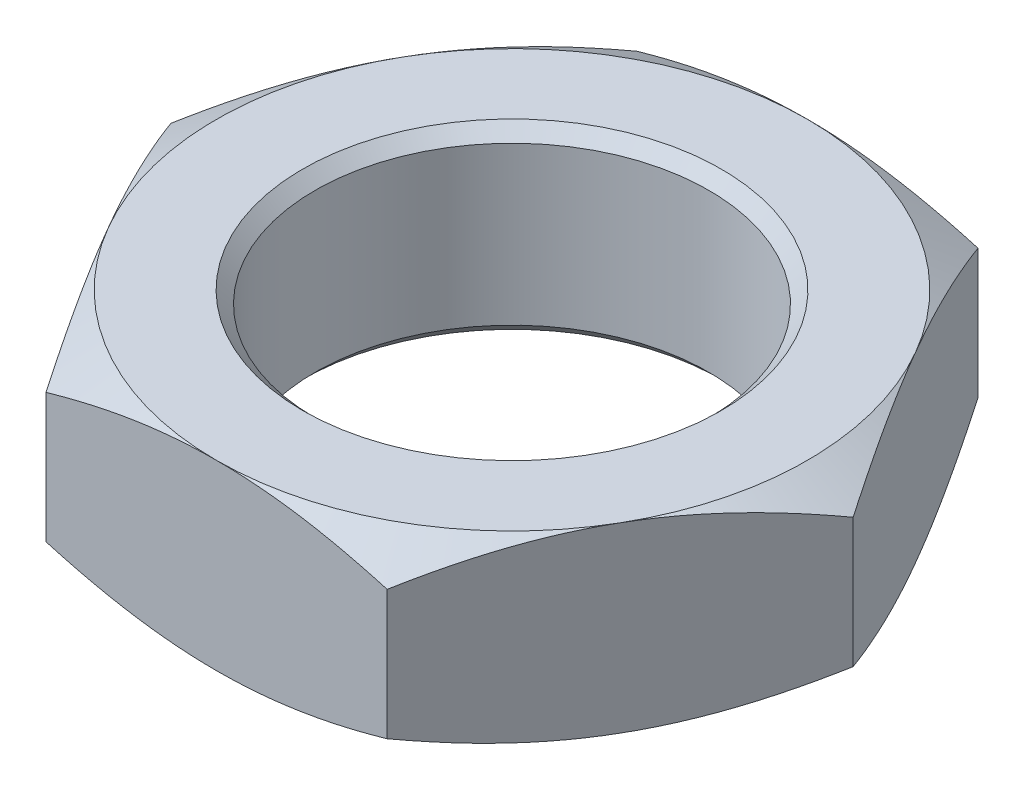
ISO-10303-21;
HEADER;
FILE_DESCRIPTION(('STEP AP214'),'2;1');
FILE_NAME('part.step','',(''),(''),'','','');
FILE_SCHEMA(('AUTOMOTIVE_DESIGN { 1 0 10303 214 1 1 1 1 }'));
ENDSEC;
DATA;
#1=APPLICATION_CONTEXT('core data for automotive mechanical design processes');
#2=APPLICATION_PROTOCOL_DEFINITION('international standard','automotive_design',2000,#1);
#3=PRODUCT_CONTEXT('',#1,'mechanical');
#4=PRODUCT('Part','Part','',(#3));
#5=PRODUCT_RELATED_PRODUCT_CATEGORY('part','',(#4));
#6=PRODUCT_DEFINITION_FORMATION('','',#4);
#7=PRODUCT_DEFINITION_CONTEXT('part definition',#1,'design');
#8=PRODUCT_DEFINITION('design','',#6,#7);
#9=PRODUCT_DEFINITION_SHAPE('','',#8);
#10=(LENGTH_UNIT() NAMED_UNIT(*) SI_UNIT(.MILLI.,.METRE.));
#11=(NAMED_UNIT(*) PLANE_ANGLE_UNIT() SI_UNIT($,.RADIAN.));
#12=(NAMED_UNIT(*) SI_UNIT($,.STERADIAN.) SOLID_ANGLE_UNIT());
#13=UNCERTAINTY_MEASURE_WITH_UNIT(LENGTH_MEASURE(1.E-05),#10,'distance_accuracy_value','');
#14=(GEOMETRIC_REPRESENTATION_CONTEXT(3) GLOBAL_UNCERTAINTY_ASSIGNED_CONTEXT((#13)) GLOBAL_UNIT_ASSIGNED_CONTEXT((#10,
#11,#12)) REPRESENTATION_CONTEXT('',''));
#15=CARTESIAN_POINT('',(0.,0.,0.));
#16=DIRECTION('',(0.,0.,1.));
#17=DIRECTION('',(1.,0.,0.));
#18=AXIS2_PLACEMENT_3D('',#15,#16,#17);
#19=CARTESIAN_POINT('',(0.,3.7,0.));
#20=DIRECTION('',(0.,1.,0.));
#21=DIRECTION('',(0.,0.,1.));
#22=AXIS2_PLACEMENT_3D('',#19,#20,#21);
#23=PLANE('',#22);
#24=CARTESIAN_POINT('',(0.,3.7,0.));
#25=DIRECTION('',(0.,1.,0.));
#26=DIRECTION('',(0.,0.,1.));
#27=AXIS2_PLACEMENT_3D('',#24,#25,#26);
#28=CIRCLE('',#27,8.5);
#29=CARTESIAN_POINT('',(0.,3.7,8.5));
#30=VERTEX_POINT('',#29);
#31=EDGE_CURVE('E11',#30,#30,#28,.F.);
#32=ORIENTED_EDGE('',*,*,#31,.T.);
#33=EDGE_LOOP('',(#32));
#34=FACE_BOUND('',#33,.T.);
#35=CARTESIAN_POINT('',(0.,3.7,0.));
#36=DIRECTION('',(0.,1.,0.));
#37=DIRECTION('',(0.,0.,1.));
#38=AXIS2_PLACEMENT_3D('',#35,#36,#37);
#39=CIRCLE('',#38,12.);
#40=CARTESIAN_POINT('',(-10.3923048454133,3.7,6.));
#41=VERTEX_POINT('',#40);
#42=CARTESIAN_POINT('',(0.,3.7,12.));
#43=VERTEX_POINT('',#42);
#44=EDGE_CURVE('E142',#41,#43,#39,.T.);
#45=ORIENTED_EDGE('',*,*,#44,.T.);
#46=CARTESIAN_POINT('',(10.3923048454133,3.7,6.));
#47=VERTEX_POINT('',#46);
#48=EDGE_CURVE('E175',#43,#47,#39,.T.);
#49=ORIENTED_EDGE('',*,*,#48,.T.);
#50=CARTESIAN_POINT('',(10.3923048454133,3.7,-6.));
#51=VERTEX_POINT('',#50);
#52=EDGE_CURVE('E179',#47,#51,#39,.T.);
#53=ORIENTED_EDGE('',*,*,#52,.T.);
#54=CARTESIAN_POINT('',(0.,3.7,-12.));
#55=VERTEX_POINT('',#54);
#56=EDGE_CURVE('E322',#51,#55,#39,.T.);
#57=ORIENTED_EDGE('',*,*,#56,.T.);
#58=CARTESIAN_POINT('',(-10.3923048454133,3.7,-6.));
#59=VERTEX_POINT('',#58);
#60=EDGE_CURVE('E55',#55,#59,#39,.T.);
#61=ORIENTED_EDGE('',*,*,#60,.T.);
#62=EDGE_CURVE('E63',#59,#41,#39,.T.);
#63=ORIENTED_EDGE('',*,*,#62,.T.);
#64=EDGE_LOOP('',(#45,#49,#53,#57,#61,#63));
#65=FACE_BOUND('',#64,.T.);
#66=ADVANCED_FACE('F39',(#34,#65),#23,.T.);
#67=CARTESIAN_POINT('',(0.,-3.7,0.));
#68=DIRECTION('',(0.,1.,0.));
#69=DIRECTION('',(0.,0.,1.));
#70=AXIS2_PLACEMENT_3D('',#67,#68,#69);
#71=PLANE('',#70);
#72=CARTESIAN_POINT('',(0.,-3.7,0.));
#73=DIRECTION('',(0.,1.,0.));
#74=DIRECTION('',(0.,0.,1.));
#75=AXIS2_PLACEMENT_3D('',#72,#73,#74);
#76=CIRCLE('',#75,8.5);
#77=CARTESIAN_POINT('',(0.,-3.7,8.5));
#78=VERTEX_POINT('',#77);
#79=EDGE_CURVE('E329',#78,#78,#76,.T.);
#80=ORIENTED_EDGE('',*,*,#79,.T.);
#81=EDGE_LOOP('',(#80));
#82=FACE_BOUND('',#81,.T.);
#83=CARTESIAN_POINT('',(0.,-3.7,0.));
#84=DIRECTION('',(0.,1.,0.));
#85=DIRECTION('',(0.,0.,1.));
#86=AXIS2_PLACEMENT_3D('',#83,#84,#85);
#87=CIRCLE('',#86,12.);
#88=CARTESIAN_POINT('',(0.,-3.7,12.));
#89=VERTEX_POINT('',#88);
#90=CARTESIAN_POINT('',(10.3923048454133,-3.7,6.));
#91=VERTEX_POINT('',#90);
#92=EDGE_CURVE('E130',#89,#91,#87,.T.);
#93=ORIENTED_EDGE('',*,*,#92,.F.);
#94=CARTESIAN_POINT('',(-10.3923048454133,-3.7,6.));
#95=VERTEX_POINT('',#94);
#96=EDGE_CURVE('E145',#95,#89,#87,.T.);
#97=ORIENTED_EDGE('',*,*,#96,.F.);
#98=CARTESIAN_POINT('',(-10.3923048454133,-3.7,-6.));
#99=VERTEX_POINT('',#98);
#100=EDGE_CURVE('E387',#99,#95,#87,.T.);
#101=ORIENTED_EDGE('',*,*,#100,.F.);
#102=CARTESIAN_POINT('',(0.,-3.7,-12.));
#103=VERTEX_POINT('',#102);
#104=EDGE_CURVE('E173',#103,#99,#87,.T.);
#105=ORIENTED_EDGE('',*,*,#104,.F.);
#106=CARTESIAN_POINT('',(10.3923048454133,-3.7,-6.));
#107=VERTEX_POINT('',#106);
#108=EDGE_CURVE('E169',#107,#103,#87,.T.);
#109=ORIENTED_EDGE('',*,*,#108,.F.);
#110=EDGE_CURVE('E143',#91,#107,#87,.T.);
#111=ORIENTED_EDGE('',*,*,#110,.F.);
#112=EDGE_LOOP('',(#93,#97,#101,#105,#109,#111));
#113=FACE_BOUND('',#112,.T.);
#114=ADVANCED_FACE('F167',(#82,#113),#71,.F.);
#115=CARTESIAN_POINT('',(0.,3.7,0.));
#116=DIRECTION('',(0.,-1.,0.));
#117=DIRECTION('',(0.,0.,-1.));
#118=AXIS2_PLACEMENT_3D('',#115,#116,#117);
#119=CYLINDRICAL_SURFACE('',#118,8.);
#120=CARTESIAN_POINT('',(0.,-3.2,0.));
#121=DIRECTION('',(0.,1.,0.));
#122=DIRECTION('',(0.,0.,1.));
#123=AXIS2_PLACEMENT_3D('',#120,#121,#122);
#124=CIRCLE('',#123,8.);
#125=CARTESIAN_POINT('',(0.,-3.2,8.));
#126=VERTEX_POINT('',#125);
#127=EDGE_CURVE('E48',#126,#126,#124,.F.);
#128=ORIENTED_EDGE('',*,*,#127,.T.);
#129=EDGE_LOOP('',(#128));
#130=FACE_BOUND('',#129,.T.);
#131=CARTESIAN_POINT('',(0.,3.2,0.));
#132=DIRECTION('',(0.,1.,0.));
#133=DIRECTION('',(0.,0.,1.));
#134=AXIS2_PLACEMENT_3D('',#131,#132,#133);
#135=CIRCLE('',#134,8.);
#136=CARTESIAN_POINT('',(0.,3.2,8.));
#137=VERTEX_POINT('',#136);
#138=EDGE_CURVE('E326',#137,#137,#135,.T.);
#139=ORIENTED_EDGE('',*,*,#138,.T.);
#140=EDGE_LOOP('',(#139));
#141=FACE_BOUND('',#140,.T.);
#142=ADVANCED_FACE('F202',(#130,#141),#119,.F.);
#143=CARTESIAN_POINT('',(0.,-3.7,0.));
#144=DIRECTION('',(0.,1.,0.));
#145=DIRECTION('',(0.,0.,1.));
#146=AXIS2_PLACEMENT_3D('',#143,#144,#145);
#147=CONICAL_SURFACE('',#146,12.,1.0471975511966);
#148=CARTESIAN_POINT('',(6.92808776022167,-2.62813656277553,12.0002));
#149=CARTESIAN_POINT('',(7.08038456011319,-2.71605036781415,11.7364142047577));
#150=CARTESIAN_POINT('',(7.23324920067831,-2.79997400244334,11.4716448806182));
#151=CARTESIAN_POINT('',(7.54020434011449,-2.95873378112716,10.9399829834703));
#152=CARTESIAN_POINT('',(7.69429522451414,-3.03356693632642,10.6730897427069));
#153=CARTESIAN_POINT('',(8.15905073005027,-3.24298246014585,9.86810959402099));
#154=CARTESIAN_POINT('',(8.47155003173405,-3.36209676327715,9.3268449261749));
#155=CARTESIAN_POINT('',(8.93919090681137,-3.50176893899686,8.51686717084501));
#156=CARTESIAN_POINT('',(9.09293539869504,-3.54155620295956,8.25057389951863));
#157=CARTESIAN_POINT('',(9.40113622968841,-3.60827663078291,7.71675440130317));
#158=CARTESIAN_POINT('',(9.55559258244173,-3.63520954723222,7.44922815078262));
#159=CARTESIAN_POINT('',(9.86476279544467,-3.67553140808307,6.91372963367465));
#160=CARTESIAN_POINT('',(10.0194761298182,-3.68893644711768,6.64575827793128));
#161=CARTESIAN_POINT('',(10.3290461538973,-3.70191690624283,6.10956726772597));
#162=CARTESIAN_POINT('',(10.4839028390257,-3.70149275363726,5.84134762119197));
#163=CARTESIAN_POINT('',(10.7734076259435,-3.68777998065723,5.3399106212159));
#164=CARTESIAN_POINT('',(10.908076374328,-3.67616401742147,5.10665750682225));
#165=CARTESIAN_POINT('',(11.1771041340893,-3.64269199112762,4.64068775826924));
#166=CARTESIAN_POINT('',(11.3114631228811,-3.62083520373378,4.40797116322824));
#167=CARTESIAN_POINT('',(11.5797983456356,-3.56726258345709,3.94320092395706));
#168=CARTESIAN_POINT('',(11.7137741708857,-3.53553860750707,3.711147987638));
#169=CARTESIAN_POINT('',(11.9810977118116,-3.46278822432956,3.24813003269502));
#170=CARTESIAN_POINT('',(12.1144453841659,-3.4217611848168,3.01716508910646));
#171=CARTESIAN_POINT('',(12.5192297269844,-3.2836883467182,2.31605804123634));
#172=CARTESIAN_POINT('',(12.789494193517,-3.17287511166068,1.84794625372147));
#173=CARTESIAN_POINT('',(13.3259930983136,-2.92137423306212,0.918702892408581));
#174=CARTESIAN_POINT('',(13.5922344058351,-2.78074565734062,0.457559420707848));
#175=CARTESIAN_POINT('',(13.8565219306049,-2.62813656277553,-0.000199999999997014));
#176=B_SPLINE_CURVE_WITH_KNOTS('',3,(#148,#149,#150,#151,#152,#153,#154,#155,#156,#157,#158,
#159,#160,#161,#162,#163,#164,#165,#166,#167,#168,#169,#170,#171,#172,#173,#174,#175),
.UNSPECIFIED.,.F.,.F.,(4,2,2,2,2,2,2,2,2,2,2,2,2,4),(0.,0.951004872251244,1.90232158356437,
3.80900466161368,4.7389455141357,5.66890426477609,6.59775529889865,7.5265776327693,
8.33514643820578,9.14377244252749,9.95306755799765,10.7624176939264,12.4167102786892,
14.0677556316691),.UNSPECIFIED.);
#177=CARTESIAN_POINT('',(13.856406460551,-2.62820323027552,0.));
#178=VERTEX_POINT('',#177);
#179=EDGE_CURVE('E148',#91,#178,#176,.T.);
#180=ORIENTED_EDGE('',*,*,#179,.F.);
#181=ORIENTED_EDGE('',*,*,#110,.T.);
#182=CARTESIAN_POINT('',(13.8565219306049,-2.62813656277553,0.000200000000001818));
#183=CARTESIAN_POINT('',(13.7042251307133,-2.71605036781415,-0.26358579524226));
#184=CARTESIAN_POINT('',(13.5513604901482,-2.79997400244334,-0.528355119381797));
#185=CARTESIAN_POINT('',(13.244405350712,-2.95873378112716,-1.06001701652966));
#186=CARTESIAN_POINT('',(13.0903144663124,-3.03356693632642,-1.32691025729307));
#187=CARTESIAN_POINT('',(12.6255589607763,-3.24298246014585,-2.13189040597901));
#188=CARTESIAN_POINT('',(12.3130596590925,-3.36209676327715,-2.6731550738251));
#189=CARTESIAN_POINT('',(11.8454187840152,-3.50176893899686,-3.48313282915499));
#190=CARTESIAN_POINT('',(11.6916742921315,-3.54155620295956,-3.74942610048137));
#191=CARTESIAN_POINT('',(11.3834734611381,-3.60827663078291,-4.28324559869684));
#192=CARTESIAN_POINT('',(11.2290171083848,-3.63520954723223,-4.55077184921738));
#193=CARTESIAN_POINT('',(10.9198468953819,-3.67553140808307,-5.08627036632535));
#194=CARTESIAN_POINT('',(10.7651335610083,-3.68893644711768,-5.35424172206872));
#195=CARTESIAN_POINT('',(10.4555635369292,-3.70191690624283,-5.89043273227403));
#196=CARTESIAN_POINT('',(10.3007068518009,-3.70149275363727,-6.15865237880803));
#197=CARTESIAN_POINT('',(10.0112020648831,-3.68777998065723,-6.6600893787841));
#198=CARTESIAN_POINT('',(9.87653331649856,-3.67616401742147,-6.89334249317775));
#199=CARTESIAN_POINT('',(9.60750555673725,-3.64269199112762,-7.35931224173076));
#200=CARTESIAN_POINT('',(9.47314656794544,-3.62083520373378,-7.59202883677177));
#201=CARTESIAN_POINT('',(9.2048113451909,-3.56726258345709,-8.05679907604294));
#202=CARTESIAN_POINT('',(9.07083551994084,-3.53553860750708,-8.288852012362));
#203=CARTESIAN_POINT('',(8.80351197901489,-3.46278822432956,-8.75186996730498));
#204=CARTESIAN_POINT('',(8.67016430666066,-3.4217611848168,-8.98283491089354));
#205=CARTESIAN_POINT('',(8.2653799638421,-3.2836883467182,-9.68394195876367));
#206=CARTESIAN_POINT('',(7.99511549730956,-3.17287511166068,-10.1520537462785));
#207=CARTESIAN_POINT('',(7.45861659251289,-2.92137423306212,-11.0812971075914));
#208=CARTESIAN_POINT('',(7.19237528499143,-2.78074565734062,-11.5424405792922));
#209=CARTESIAN_POINT('',(6.92808776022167,-2.62813656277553,-12.0002));
#210=B_SPLINE_CURVE_WITH_KNOTS('',3,(#182,#183,#184,#185,#186,#187,#188,#189,#190,#191,#192,
#193,#194,#195,#196,#197,#198,#199,#200,#201,#202,#203,#204,#205,#206,#207,#208,#209),
.UNSPECIFIED.,.F.,.F.,(4,2,2,2,2,2,2,2,2,2,2,2,2,4),(0.,0.951004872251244,1.90232158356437,
3.80900466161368,4.7389455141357,5.66890426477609,6.59775529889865,7.5265776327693,
8.33514643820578,9.14377244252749,9.95306755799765,10.7624176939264,12.4167102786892,
14.0677556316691),.UNSPECIFIED.);
#211=EDGE_CURVE('E152',#178,#107,#210,.T.);
#212=ORIENTED_EDGE('',*,*,#211,.F.);
#213=EDGE_LOOP('',(#180,#181,#212));
#214=FACE_BOUND('',#213,.T.);
#215=ADVANCED_FACE('F149',(#214),#147,.T.);
#216=ORIENTED_EDGE('',*,*,#92,.T.);
#217=CARTESIAN_POINT('',(6.92820323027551,-2.62820323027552,12.));
#218=VERTEX_POINT('',#217);
#219=EDGE_CURVE('E134',#218,#91,#176,.T.);
#220=ORIENTED_EDGE('',*,*,#219,.F.);
#221=CARTESIAN_POINT('',(-21.2702998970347,3.47174544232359,12.));
#222=CARTESIAN_POINT('',(-20.7639335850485,3.21716000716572,12.));
#223=CARTESIAN_POINT('',(-20.2567092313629,2.96426380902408,12.));
#224=CARTESIAN_POINT('',(-19.2401502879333,2.46266979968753,12.));
#225=CARTESIAN_POINT('',(-18.7308155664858,2.21397225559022,12.));
#226=CARTESIAN_POINT('',(-17.7087131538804,1.72114931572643,12.));
#227=CARTESIAN_POINT('',(-17.1959407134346,1.47703374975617,12.));
#228=CARTESIAN_POINT('',(-16.1674911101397,0.995013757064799,12.));
#229=CARTESIAN_POINT('',(-15.6518140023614,0.757109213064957,12.));
#230=CARTESIAN_POINT('',(-14.5930001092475,0.278101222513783,12.));
#231=CARTESIAN_POINT('',(-14.0496985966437,0.0373607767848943,12.));
#232=CARTESIAN_POINT('',(-12.9584973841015,-0.43357668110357,12.));
#233=CARTESIAN_POINT('',(-12.4105974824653,-0.663773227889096,12.));
#234=CARTESIAN_POINT('',(-11.3096506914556,-1.11058873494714,12.));
#235=CARTESIAN_POINT('',(-10.7566071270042,-1.32721584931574,12.));
#236=CARTESIAN_POINT('',(-9.64407622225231,-1.7432264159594,12.));
#237=CARTESIAN_POINT('',(-9.08458958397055,-1.94261172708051,12.));
#238=CARTESIAN_POINT('',(-8.17724161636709,-2.24590472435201,12.));
#239=CARTESIAN_POINT('',(-7.83171702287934,-2.35678284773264,12.));
#240=CARTESIAN_POINT('',(-7.13770939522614,-2.56883747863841,12.));
#241=CARTESIAN_POINT('',(-6.78922625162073,-2.67001362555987,12.));
#242=CARTESIAN_POINT('',(-5.73907297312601,-2.95668448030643,12.));
#243=CARTESIAN_POINT('',(-5.03257832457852,-3.12536303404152,12.));
#244=CARTESIAN_POINT('',(-3.97045942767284,-3.33308731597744,12.));
#245=CARTESIAN_POINT('',(-3.6191323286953,-3.39443177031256,12.));
#246=CARTESIAN_POINT('',(-2.9140550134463,-3.50135101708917,12.));
#247=CARTESIAN_POINT('',(-2.5603048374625,-3.54692607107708,12.));
#248=CARTESIAN_POINT('',(-1.8511397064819,-3.62094080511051,12.));
#249=CARTESIAN_POINT('',(-1.49572543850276,-3.64938701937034,12.));
#250=CARTESIAN_POINT('',(-0.783904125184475,-3.68824661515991,12.));
#251=CARTESIAN_POINT('',(-0.427497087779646,-3.69866014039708,12.));
#252=CARTESIAN_POINT('',(0.287951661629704,-3.70110571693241,12.));
#253=CARTESIAN_POINT('',(0.646993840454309,-3.69300468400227,12.));
#254=CARTESIAN_POINT('',(1.36418525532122,-3.65842854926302,12.));
#255=CARTESIAN_POINT('',(1.72233448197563,-3.63195325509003,12.));
#256=CARTESIAN_POINT('',(2.4370320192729,-3.56149560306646,12.));
#257=CARTESIAN_POINT('',(2.79357966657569,-3.51750656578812,12.));
#258=CARTESIAN_POINT('',(3.50427345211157,-3.41336379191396,12.));
#259=CARTESIAN_POINT('',(3.85841954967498,-3.35320978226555,12.));
#260=CARTESIAN_POINT('',(4.92914871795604,-3.14850657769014,12.));
#261=CARTESIAN_POINT('',(5.64142035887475,-2.98105372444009,12.));
#262=CARTESIAN_POINT('',(6.70007868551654,-2.69528445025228,12.));
#263=CARTESIAN_POINT('',(7.05137518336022,-2.59425098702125,12.));
#264=CARTESIAN_POINT('',(7.75095423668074,-2.38221939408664,12.));
#265=CARTESIAN_POINT('',(8.09923690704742,-2.27122164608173,12.));
#266=CARTESIAN_POINT('',(9.01295879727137,-1.96760013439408,12.));
#267=CARTESIAN_POINT('',(9.57602495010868,-1.76785644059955,12.));
#268=CARTESIAN_POINT('',(10.6955995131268,-1.35075560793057,12.));
#269=CARTESIAN_POINT('',(11.25210718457,-1.13339650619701,12.));
#270=CARTESIAN_POINT('',(12.359892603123,-0.684847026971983,12.));
#271=CARTESIAN_POINT('',(12.9111669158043,-0.453648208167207,12.));
#272=CARTESIAN_POINT('',(14.0090390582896,0.0194853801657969,12.));
#273=CARTESIAN_POINT('',(14.5556371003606,0.261419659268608,12.));
#274=CARTESIAN_POINT('',(15.6206519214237,0.742813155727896,12.));
#275=CARTESIAN_POINT('',(16.1392372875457,0.981900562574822,12.));
#276=CARTESIAN_POINT('',(17.1734630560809,1.46637608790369,12.));
#277=CARTESIAN_POINT('',(17.6891034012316,1.71176432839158,12.));
#278=CARTESIAN_POINT('',(18.7168782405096,2.20718422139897,12.));
#279=CARTESIAN_POINT('',(19.2290176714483,2.45720565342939,12.));
#280=CARTESIAN_POINT('',(20.2511603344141,2.96149772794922,12.));
#281=CARTESIAN_POINT('',(20.7611637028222,3.21576809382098,12.));
#282=CARTESIAN_POINT('',(21.2702998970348,3.4717454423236,12.));
#283=B_SPLINE_CURVE_WITH_KNOTS('',3,(#221,#222,#223,#224,#225,#226,#227,#228,#229,#230,#231,
#232,#233,#234,#235,#236,#237,#238,#239,#240,#241,#242,#243,#244,#245,#246,#247,#248,#249,#250,
#251,#252,#253,#254,#255,#256,#257,#258,#259,#260,#261,#262,#263,#264,#265,#266,#267,#268,#269,
#270,#271,#272,#273,#274,#275,#276,#277,#278,#279,#280,#281,#282),.UNSPECIFIED.,.F.,.F.,(4,2,2,
2,2,2,2,2,2,2,2,2,2,2,2,2,2,2,2,2,2,2,2,2,2,2,2,2,2,2,4),(0.,1.70029824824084,3.40070425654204,
5.10441636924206,6.80809628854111,8.59075751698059,10.3734973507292,12.1551554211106,
13.9366211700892,15.0251214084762,16.1136620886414,18.2903612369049,19.3600026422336,
20.4296263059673,21.498841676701,22.5680485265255,23.6449650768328,24.7218929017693,
25.7992318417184,26.8765889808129,29.0691954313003,30.1657218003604,31.2622061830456,
33.0541351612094,34.8462640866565,36.6394974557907,38.4326489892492,40.1457366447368,
41.8588574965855,43.5685666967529,45.2781650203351),.UNSPECIFIED.);
#284=EDGE_CURVE('E136',#89,#218,#283,.T.);
#285=ORIENTED_EDGE('',*,*,#284,.F.);
#286=EDGE_LOOP('',(#216,#220,#285));
#287=FACE_BOUND('',#286,.T.);
#288=ADVANCED_FACE('F132',(#287),#147,.T.);
#289=CARTESIAN_POINT('',(0.,3.7,0.));
#290=DIRECTION('',(0.,-1.,0.));
#291=DIRECTION('',(0.,0.,-1.));
#292=AXIS2_PLACEMENT_3D('',#289,#290,#291);
#293=CONICAL_SURFACE('',#292,12.,1.0471975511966);
#294=CARTESIAN_POINT('',(13.8565219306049,2.62813656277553,0.000200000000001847));
#295=CARTESIAN_POINT('',(13.7042251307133,2.71605036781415,-0.26358579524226));
#296=CARTESIAN_POINT('',(13.5513604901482,2.79997400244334,-0.528355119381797));
#297=CARTESIAN_POINT('',(13.244405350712,2.95873378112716,-1.06001701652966));
#298=CARTESIAN_POINT('',(13.0903144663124,3.03356693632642,-1.32691025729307));
#299=CARTESIAN_POINT('',(12.6255589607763,3.24298246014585,-2.13189040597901));
#300=CARTESIAN_POINT('',(12.3130596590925,3.36209676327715,-2.6731550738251));
#301=CARTESIAN_POINT('',(11.8454187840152,3.50176893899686,-3.48313282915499));
#302=CARTESIAN_POINT('',(11.6916742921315,3.54155620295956,-3.74942610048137));
#303=CARTESIAN_POINT('',(11.3834734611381,3.60827663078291,-4.28324559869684));
#304=CARTESIAN_POINT('',(11.2290171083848,3.63520954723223,-4.55077184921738));
#305=CARTESIAN_POINT('',(10.9198468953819,3.67553140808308,-5.08627036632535));
#306=CARTESIAN_POINT('',(10.7651335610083,3.68893644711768,-5.35424172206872));
#307=CARTESIAN_POINT('',(10.4555635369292,3.70191690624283,-5.89043273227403));
#308=CARTESIAN_POINT('',(10.3007068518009,3.70149275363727,-6.15865237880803));
#309=CARTESIAN_POINT('',(10.0112020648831,3.68777998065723,-6.6600893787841));
#310=CARTESIAN_POINT('',(9.87653331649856,3.67616401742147,-6.89334249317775));
#311=CARTESIAN_POINT('',(9.60750555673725,3.64269199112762,-7.35931224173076));
#312=CARTESIAN_POINT('',(9.47314656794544,3.62083520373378,-7.59202883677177));
#313=CARTESIAN_POINT('',(9.2048113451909,3.56726258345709,-8.05679907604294));
#314=CARTESIAN_POINT('',(9.07083551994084,3.53553860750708,-8.288852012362));
#315=CARTESIAN_POINT('',(8.80351197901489,3.46278822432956,-8.75186996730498));
#316=CARTESIAN_POINT('',(8.67016430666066,3.4217611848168,-8.98283491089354));
#317=CARTESIAN_POINT('',(8.2653799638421,3.2836883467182,-9.68394195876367));
#318=CARTESIAN_POINT('',(7.99511549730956,3.17287511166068,-10.1520537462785));
#319=CARTESIAN_POINT('',(7.45861659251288,2.92137423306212,-11.0812971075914));
#320=CARTESIAN_POINT('',(7.19237528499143,2.78074565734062,-11.5424405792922));
#321=CARTESIAN_POINT('',(6.92808776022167,2.62813656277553,-12.0002));
#322=B_SPLINE_CURVE_WITH_KNOTS('',3,(#294,#295,#296,#297,#298,#299,#300,#301,#302,#303,#304,
#305,#306,#307,#308,#309,#310,#311,#312,#313,#314,#315,#316,#317,#318,#319,#320,#321),
.UNSPECIFIED.,.F.,.F.,(4,2,2,2,2,2,2,2,2,2,2,2,2,4),(0.,0.951004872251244,1.90232158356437,
3.80900466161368,4.7389455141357,5.66890426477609,6.59775529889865,7.5265776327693,
8.33514643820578,9.14377244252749,9.95306755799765,10.7624176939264,12.4167102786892,
14.0677556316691),.UNSPECIFIED.);
#323=CARTESIAN_POINT('',(13.856406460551,2.62820323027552,0.));
#324=VERTEX_POINT('',#323);
#325=EDGE_CURVE('E276',#324,#51,#322,.T.);
#326=ORIENTED_EDGE('',*,*,#325,.T.);
#327=ORIENTED_EDGE('',*,*,#52,.F.);
#328=CARTESIAN_POINT('',(6.92808776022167,2.62813656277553,12.0002));
#329=CARTESIAN_POINT('',(7.08038456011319,2.71605036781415,11.7364142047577));
#330=CARTESIAN_POINT('',(7.23324920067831,2.79997400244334,11.4716448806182));
#331=CARTESIAN_POINT('',(7.54020434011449,2.95873378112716,10.9399829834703));
#332=CARTESIAN_POINT('',(7.69429522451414,3.03356693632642,10.6730897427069));
#333=CARTESIAN_POINT('',(8.15905073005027,3.24298246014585,9.86810959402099));
#334=CARTESIAN_POINT('',(8.47155003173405,3.36209676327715,9.3268449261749));
#335=CARTESIAN_POINT('',(8.93919090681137,3.50176893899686,8.51686717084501));
#336=CARTESIAN_POINT('',(9.09293539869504,3.54155620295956,8.25057389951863));
#337=CARTESIAN_POINT('',(9.40113622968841,3.60827663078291,7.71675440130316));
#338=CARTESIAN_POINT('',(9.55559258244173,3.63520954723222,7.44922815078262));
#339=CARTESIAN_POINT('',(9.86476279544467,3.67553140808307,6.91372963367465));
#340=CARTESIAN_POINT('',(10.0194761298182,3.68893644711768,6.64575827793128));
#341=CARTESIAN_POINT('',(10.3290461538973,3.70191690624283,6.10956726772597));
#342=CARTESIAN_POINT('',(10.4839028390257,3.70149275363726,5.84134762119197));
#343=CARTESIAN_POINT('',(10.7734076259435,3.68777998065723,5.3399106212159));
#344=CARTESIAN_POINT('',(10.908076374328,3.67616401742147,5.10665750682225));
#345=CARTESIAN_POINT('',(11.1771041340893,3.64269199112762,4.64068775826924));
#346=CARTESIAN_POINT('',(11.3114631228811,3.62083520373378,4.40797116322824));
#347=CARTESIAN_POINT('',(11.5797983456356,3.56726258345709,3.94320092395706));
#348=CARTESIAN_POINT('',(11.7137741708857,3.53553860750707,3.711147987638));
#349=CARTESIAN_POINT('',(11.9810977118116,3.46278822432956,3.24813003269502));
#350=CARTESIAN_POINT('',(12.1144453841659,3.4217611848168,3.01716508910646));
#351=CARTESIAN_POINT('',(12.5192297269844,3.2836883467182,2.31605804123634));
#352=CARTESIAN_POINT('',(12.789494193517,3.17287511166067,1.84794625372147));
#353=CARTESIAN_POINT('',(13.3259930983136,2.92137423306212,0.91870289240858));
#354=CARTESIAN_POINT('',(13.5922344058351,2.78074565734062,0.457559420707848));
#355=CARTESIAN_POINT('',(13.8565219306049,2.62813656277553,-0.000199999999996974));
#356=B_SPLINE_CURVE_WITH_KNOTS('',3,(#328,#329,#330,#331,#332,#333,#334,#335,#336,#337,#338,
#339,#340,#341,#342,#343,#344,#345,#346,#347,#348,#349,#350,#351,#352,#353,#354,#355),
.UNSPECIFIED.,.F.,.F.,(4,2,2,2,2,2,2,2,2,2,2,2,2,4),(0.,0.951004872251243,1.90232158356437,
3.80900466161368,4.7389455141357,5.66890426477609,6.59775529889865,7.5265776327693,
8.33514643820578,9.14377244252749,9.95306755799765,10.7624176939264,12.4167102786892,
14.0677556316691),.UNSPECIFIED.);
#357=EDGE_CURVE('E165',#47,#324,#356,.T.);
#358=ORIENTED_EDGE('',*,*,#357,.T.);
#359=EDGE_LOOP('',(#326,#327,#358));
#360=FACE_BOUND('',#359,.T.);
#361=ADVANCED_FACE('F204',(#360),#293,.T.);
#362=CARTESIAN_POINT('',(-21.2702998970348,-3.4717454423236,12.));
#363=CARTESIAN_POINT('',(-20.7639335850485,-3.21716000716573,12.));
#364=CARTESIAN_POINT('',(-20.2567092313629,-2.96426380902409,12.));
#365=CARTESIAN_POINT('',(-19.2401502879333,-2.46266979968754,12.));
#366=CARTESIAN_POINT('',(-18.7308155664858,-2.21397225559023,12.));
#367=CARTESIAN_POINT('',(-17.7087131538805,-1.72114931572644,12.));
#368=CARTESIAN_POINT('',(-17.1959407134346,-1.47703374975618,12.));
#369=CARTESIAN_POINT('',(-16.1674911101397,-0.995013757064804,12.));
#370=CARTESIAN_POINT('',(-15.6518140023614,-0.757109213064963,12.));
#371=CARTESIAN_POINT('',(-14.5930001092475,-0.27810122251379,12.));
#372=CARTESIAN_POINT('',(-14.0496985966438,-0.0373607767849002,12.));
#373=CARTESIAN_POINT('',(-12.9584973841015,0.433576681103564,12.));
#374=CARTESIAN_POINT('',(-12.4105974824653,0.66377322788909,12.));
#375=CARTESIAN_POINT('',(-11.3096506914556,1.11058873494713,12.));
#376=CARTESIAN_POINT('',(-10.7566071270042,1.32721584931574,12.));
#377=CARTESIAN_POINT('',(-9.64407622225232,1.7432264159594,12.));
#378=CARTESIAN_POINT('',(-9.08458958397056,1.9426117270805,12.));
#379=CARTESIAN_POINT('',(-8.1772416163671,2.24590472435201,12.));
#380=CARTESIAN_POINT('',(-7.83171702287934,2.35678284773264,12.));
#381=CARTESIAN_POINT('',(-7.13770939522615,2.56883747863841,12.));
#382=CARTESIAN_POINT('',(-6.78922625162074,2.67001362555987,12.));
#383=CARTESIAN_POINT('',(-5.73907297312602,2.95668448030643,12.));
#384=CARTESIAN_POINT('',(-5.03257832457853,3.12536303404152,12.));
#385=CARTESIAN_POINT('',(-3.97045942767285,3.33308731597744,12.));
#386=CARTESIAN_POINT('',(-3.61913232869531,3.39443177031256,12.));
#387=CARTESIAN_POINT('',(-2.91405501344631,3.50135101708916,12.));
#388=CARTESIAN_POINT('',(-2.56030483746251,3.54692607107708,12.));
#389=CARTESIAN_POINT('',(-1.85113970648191,3.62094080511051,12.));
#390=CARTESIAN_POINT('',(-1.49572543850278,3.64938701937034,12.));
#391=CARTESIAN_POINT('',(-0.783904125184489,3.68824661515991,12.));
#392=CARTESIAN_POINT('',(-0.427497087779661,3.69866014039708,12.));
#393=CARTESIAN_POINT('',(0.28795166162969,3.70110571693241,12.));
#394=CARTESIAN_POINT('',(0.646993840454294,3.69300468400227,12.));
#395=CARTESIAN_POINT('',(1.3641852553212,3.65842854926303,12.));
#396=CARTESIAN_POINT('',(1.72233448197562,3.63195325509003,12.));
#397=CARTESIAN_POINT('',(2.43703201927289,3.56149560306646,12.));
#398=CARTESIAN_POINT('',(2.79357966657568,3.51750656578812,12.));
#399=CARTESIAN_POINT('',(3.50427345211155,3.41336379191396,12.));
#400=CARTESIAN_POINT('',(3.85841954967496,3.35320978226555,12.));
#401=CARTESIAN_POINT('',(4.92914871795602,3.14850657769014,12.));
#402=CARTESIAN_POINT('',(5.64142035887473,2.9810537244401,12.));
#403=CARTESIAN_POINT('',(6.70007868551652,2.69528445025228,12.));
#404=CARTESIAN_POINT('',(7.05137518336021,2.59425098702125,12.));
#405=CARTESIAN_POINT('',(7.75095423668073,2.38221939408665,12.));
#406=CARTESIAN_POINT('',(8.0992369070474,2.27122164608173,12.));
#407=CARTESIAN_POINT('',(9.01295879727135,1.96760013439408,12.));
#408=CARTESIAN_POINT('',(9.57602495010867,1.76785644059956,12.));
#409=CARTESIAN_POINT('',(10.6955995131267,1.35075560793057,12.));
#410=CARTESIAN_POINT('',(11.25210718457,1.13339650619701,12.));
#411=CARTESIAN_POINT('',(12.359892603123,0.684847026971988,12.));
#412=CARTESIAN_POINT('',(12.9111669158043,0.453648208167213,12.));
#413=CARTESIAN_POINT('',(14.0090390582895,-0.0194853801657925,12.));
#414=CARTESIAN_POINT('',(14.5556371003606,-0.261419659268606,12.));
#415=CARTESIAN_POINT('',(15.6206519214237,-0.742813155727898,12.));
#416=CARTESIAN_POINT('',(16.1392372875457,-0.981900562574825,12.));
#417=CARTESIAN_POINT('',(17.1734630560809,-1.46637608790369,12.));
#418=CARTESIAN_POINT('',(17.6891034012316,-1.71176432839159,12.));
#419=CARTESIAN_POINT('',(18.7168782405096,-2.20718422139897,12.));
#420=CARTESIAN_POINT('',(19.2290176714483,-2.4572056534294,12.));
#421=CARTESIAN_POINT('',(20.2511603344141,-2.96149772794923,12.));
#422=CARTESIAN_POINT('',(20.7611637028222,-3.21576809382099,12.));
#423=CARTESIAN_POINT('',(21.2702998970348,-3.4717454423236,12.));
#424=B_SPLINE_CURVE_WITH_KNOTS('',3,(#362,#363,#364,#365,#366,#367,#368,#369,#370,#371,#372,
#373,#374,#375,#376,#377,#378,#379,#380,#381,#382,#383,#384,#385,#386,#387,#388,#389,#390,#391,
#392,#393,#394,#395,#396,#397,#398,#399,#400,#401,#402,#403,#404,#405,#406,#407,#408,#409,#410,
#411,#412,#413,#414,#415,#416,#417,#418,#419,#420,#421,#422,#423),.UNSPECIFIED.,.F.,.F.,(4,2,2,
2,2,2,2,2,2,2,2,2,2,2,2,2,2,2,2,2,2,2,2,2,2,2,2,2,2,2,4),(0.,1.70029824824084,3.40070425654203,
5.10441636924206,6.80809628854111,8.59075751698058,10.3734973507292,12.1551554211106,
13.9366211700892,15.0251214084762,16.1136620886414,18.2903612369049,19.3600026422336,
20.4296263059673,21.498841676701,22.5680485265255,23.6449650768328,24.7218929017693,
25.7992318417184,26.8765889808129,29.0691954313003,30.1657218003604,31.2622061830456,
33.0541351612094,34.8462640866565,36.6394974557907,38.4326489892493,40.1457366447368,
41.8588574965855,43.5685666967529,45.2781650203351),.UNSPECIFIED.);
#425=CARTESIAN_POINT('',(6.92820323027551,2.62820323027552,12.));
#426=VERTEX_POINT('',#425);
#427=EDGE_CURVE('E308',#43,#426,#424,.T.);
#428=ORIENTED_EDGE('',*,*,#427,.T.);
#429=EDGE_CURVE('E335',#426,#47,#356,.T.);
#430=ORIENTED_EDGE('',*,*,#429,.T.);
#431=ORIENTED_EDGE('',*,*,#48,.F.);
#432=EDGE_LOOP('',(#428,#430,#431));
#433=FACE_BOUND('',#432,.T.);
#434=ADVANCED_FACE('F340',(#433),#293,.T.);
#435=ORIENTED_EDGE('',*,*,#96,.T.);
#436=CARTESIAN_POINT('',(-6.92820323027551,-2.62820323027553,12.));
#437=VERTEX_POINT('',#436);
#438=EDGE_CURVE('E188',#437,#89,#283,.T.);
#439=ORIENTED_EDGE('',*,*,#438,.F.);
#440=CARTESIAN_POINT('',(-13.8565219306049,-2.62813656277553,-0.000200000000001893));
#441=CARTESIAN_POINT('',(-13.7042251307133,-2.71605036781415,0.26358579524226));
#442=CARTESIAN_POINT('',(-13.5513604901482,-2.79997400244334,0.528355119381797));
#443=CARTESIAN_POINT('',(-13.244405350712,-2.95873378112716,1.06001701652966));
#444=CARTESIAN_POINT('',(-13.0903144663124,-3.03356693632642,1.32691025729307));
#445=CARTESIAN_POINT('',(-12.6255589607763,-3.24298246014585,2.13189040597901));
#446=CARTESIAN_POINT('',(-12.3130596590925,-3.36209676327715,2.6731550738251));
#447=CARTESIAN_POINT('',(-11.8454187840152,-3.50176893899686,3.48313282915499));
#448=CARTESIAN_POINT('',(-11.6916742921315,-3.54155620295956,3.74942610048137));
#449=CARTESIAN_POINT('',(-11.3834734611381,-3.60827663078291,4.28324559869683));
#450=CARTESIAN_POINT('',(-11.2290171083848,-3.63520954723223,4.55077184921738));
#451=CARTESIAN_POINT('',(-10.9198468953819,-3.67553140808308,5.08627036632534));
#452=CARTESIAN_POINT('',(-10.7651335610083,-3.68893644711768,5.35424172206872));
#453=CARTESIAN_POINT('',(-10.4555635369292,-3.70191690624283,5.89043273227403));
#454=CARTESIAN_POINT('',(-10.3007068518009,-3.70149275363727,6.15865237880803));
#455=CARTESIAN_POINT('',(-10.0112020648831,-3.68777998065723,6.6600893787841));
#456=CARTESIAN_POINT('',(-9.87653331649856,-3.67616401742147,6.89334249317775));
#457=CARTESIAN_POINT('',(-9.60750555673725,-3.64269199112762,7.35931224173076));
#458=CARTESIAN_POINT('',(-9.47314656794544,-3.62083520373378,7.59202883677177));
#459=CARTESIAN_POINT('',(-9.2048113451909,-3.56726258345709,8.05679907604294));
#460=CARTESIAN_POINT('',(-9.07083551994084,-3.53553860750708,8.288852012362));
#461=CARTESIAN_POINT('',(-8.80351197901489,-3.46278822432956,8.75186996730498));
#462=CARTESIAN_POINT('',(-8.67016430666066,-3.4217611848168,8.98283491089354));
#463=CARTESIAN_POINT('',(-8.2653799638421,-3.2836883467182,9.68394195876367));
#464=CARTESIAN_POINT('',(-7.99511549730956,-3.17287511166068,10.1520537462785));
#465=CARTESIAN_POINT('',(-7.45861659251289,-2.92137423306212,11.0812971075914));
#466=CARTESIAN_POINT('',(-7.19237528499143,-2.78074565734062,11.5424405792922));
#467=CARTESIAN_POINT('',(-6.92808776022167,-2.62813656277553,12.0002));
#468=B_SPLINE_CURVE_WITH_KNOTS('',3,(#440,#441,#442,#443,#444,#445,#446,#447,#448,#449,#450,
#451,#452,#453,#454,#455,#456,#457,#458,#459,#460,#461,#462,#463,#464,#465,#466,#467),
.UNSPECIFIED.,.F.,.F.,(4,2,2,2,2,2,2,2,2,2,2,2,2,4),(0.,0.951004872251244,1.90232158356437,
3.80900466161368,4.7389455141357,5.66890426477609,6.59775529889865,7.5265776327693,
8.33514643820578,9.14377244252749,9.95306755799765,10.7624176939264,12.4167102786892,
14.0677556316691),.UNSPECIFIED.);
#469=EDGE_CURVE('E189',#95,#437,#468,.T.);
#470=ORIENTED_EDGE('',*,*,#469,.F.);
#471=EDGE_LOOP('',(#435,#439,#470));
#472=FACE_BOUND('',#471,.T.);
#473=ADVANCED_FACE('F395',(#472),#147,.T.);
#474=CARTESIAN_POINT('',(-13.8565219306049,2.62813656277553,-0.000200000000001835));
#475=CARTESIAN_POINT('',(-13.7042251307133,2.71605036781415,0.26358579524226));
#476=CARTESIAN_POINT('',(-13.5513604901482,2.79997400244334,0.528355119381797));
#477=CARTESIAN_POINT('',(-13.244405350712,2.95873378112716,1.06001701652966));
#478=CARTESIAN_POINT('',(-13.0903144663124,3.03356693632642,1.32691025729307));
#479=CARTESIAN_POINT('',(-12.6255589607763,3.24298246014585,2.13189040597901));
#480=CARTESIAN_POINT('',(-12.3130596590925,3.36209676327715,2.6731550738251));
#481=CARTESIAN_POINT('',(-11.8454187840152,3.50176893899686,3.48313282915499));
#482=CARTESIAN_POINT('',(-11.6916742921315,3.54155620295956,3.74942610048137));
#483=CARTESIAN_POINT('',(-11.3834734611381,3.60827663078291,4.28324559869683));
#484=CARTESIAN_POINT('',(-11.2290171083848,3.63520954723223,4.55077184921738));
#485=CARTESIAN_POINT('',(-10.9198468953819,3.67553140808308,5.08627036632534));
#486=CARTESIAN_POINT('',(-10.7651335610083,3.68893644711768,5.35424172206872));
#487=CARTESIAN_POINT('',(-10.4555635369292,3.70191690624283,5.89043273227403));
#488=CARTESIAN_POINT('',(-10.3007068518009,3.70149275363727,6.15865237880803));
#489=CARTESIAN_POINT('',(-10.0112020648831,3.68777998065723,6.6600893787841));
#490=CARTESIAN_POINT('',(-9.87653331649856,3.67616401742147,6.89334249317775));
#491=CARTESIAN_POINT('',(-9.60750555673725,3.64269199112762,7.35931224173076));
#492=CARTESIAN_POINT('',(-9.47314656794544,3.62083520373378,7.59202883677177));
#493=CARTESIAN_POINT('',(-9.2048113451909,3.56726258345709,8.05679907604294));
#494=CARTESIAN_POINT('',(-9.07083551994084,3.53553860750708,8.288852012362));
#495=CARTESIAN_POINT('',(-8.80351197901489,3.46278822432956,8.75186996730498));
#496=CARTESIAN_POINT('',(-8.67016430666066,3.4217611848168,8.98283491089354));
#497=CARTESIAN_POINT('',(-8.2653799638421,3.2836883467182,9.68394195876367));
#498=CARTESIAN_POINT('',(-7.99511549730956,3.17287511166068,10.1520537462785));
#499=CARTESIAN_POINT('',(-7.45861659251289,2.92137423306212,11.0812971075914));
#500=CARTESIAN_POINT('',(-7.19237528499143,2.78074565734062,11.5424405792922));
#501=CARTESIAN_POINT('',(-6.92808776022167,2.62813656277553,12.0002));
#502=B_SPLINE_CURVE_WITH_KNOTS('',3,(#474,#475,#476,#477,#478,#479,#480,#481,#482,#483,#484,
#485,#486,#487,#488,#489,#490,#491,#492,#493,#494,#495,#496,#497,#498,#499,#500,#501),
.UNSPECIFIED.,.F.,.F.,(4,2,2,2,2,2,2,2,2,2,2,2,2,4),(0.,0.951004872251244,1.90232158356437,
3.80900466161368,4.7389455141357,5.66890426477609,6.59775529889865,7.5265776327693,
8.33514643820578,9.14377244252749,9.95306755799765,10.7624176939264,12.4167102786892,
14.0677556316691),.UNSPECIFIED.);
#503=CARTESIAN_POINT('',(-6.92820323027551,2.62820323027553,12.));
#504=VERTEX_POINT('',#503);
#505=EDGE_CURVE('E317',#41,#504,#502,.T.);
#506=ORIENTED_EDGE('',*,*,#505,.T.);
#507=EDGE_CURVE('E319',#504,#43,#424,.T.);
#508=ORIENTED_EDGE('',*,*,#507,.T.);
#509=ORIENTED_EDGE('',*,*,#44,.F.);
#510=EDGE_LOOP('',(#506,#508,#509));
#511=FACE_BOUND('',#510,.T.);
#512=ADVANCED_FACE('F421',(#511),#293,.T.);
#513=ORIENTED_EDGE('',*,*,#100,.T.);
#514=CARTESIAN_POINT('',(-13.856406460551,-2.62820323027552,0.));
#515=VERTEX_POINT('',#514);
#516=EDGE_CURVE('E314',#515,#95,#468,.T.);
#517=ORIENTED_EDGE('',*,*,#516,.F.);
#518=CARTESIAN_POINT('',(-6.92808776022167,-2.62813656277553,-12.0002));
#519=CARTESIAN_POINT('',(-7.08038456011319,-2.71605036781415,-11.7364142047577));
#520=CARTESIAN_POINT('',(-7.23324920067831,-2.79997400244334,-11.4716448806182));
#521=CARTESIAN_POINT('',(-7.54020434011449,-2.95873378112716,-10.9399829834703));
#522=CARTESIAN_POINT('',(-7.69429522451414,-3.03356693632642,-10.6730897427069));
#523=CARTESIAN_POINT('',(-8.15905073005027,-3.24298246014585,-9.86810959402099));
#524=CARTESIAN_POINT('',(-8.47155003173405,-3.36209676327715,-9.3268449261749));
#525=CARTESIAN_POINT('',(-8.93919090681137,-3.50176893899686,-8.51686717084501));
#526=CARTESIAN_POINT('',(-9.09293539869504,-3.54155620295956,-8.25057389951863));
#527=CARTESIAN_POINT('',(-9.40113622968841,-3.60827663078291,-7.71675440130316));
#528=CARTESIAN_POINT('',(-9.55559258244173,-3.63520954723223,-7.44922815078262));
#529=CARTESIAN_POINT('',(-9.86476279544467,-3.67553140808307,-6.91372963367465));
#530=CARTESIAN_POINT('',(-10.0194761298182,-3.68893644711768,-6.64575827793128));
#531=CARTESIAN_POINT('',(-10.3290461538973,-3.70191690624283,-6.10956726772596));
#532=CARTESIAN_POINT('',(-10.4839028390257,-3.70149275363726,-5.84134762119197));
#533=CARTESIAN_POINT('',(-10.7734076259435,-3.68777998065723,-5.3399106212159));
#534=CARTESIAN_POINT('',(-10.908076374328,-3.67616401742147,-5.10665750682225));
#535=CARTESIAN_POINT('',(-11.1771041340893,-3.64269199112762,-4.64068775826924));
#536=CARTESIAN_POINT('',(-11.3114631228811,-3.62083520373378,-4.40797116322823));
#537=CARTESIAN_POINT('',(-11.5797983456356,-3.56726258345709,-3.94320092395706));
#538=CARTESIAN_POINT('',(-11.7137741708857,-3.53553860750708,-3.711147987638));
#539=CARTESIAN_POINT('',(-11.9810977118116,-3.46278822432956,-3.24813003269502));
#540=CARTESIAN_POINT('',(-12.1144453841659,-3.4217611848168,-3.01716508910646));
#541=CARTESIAN_POINT('',(-12.5192297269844,-3.2836883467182,-2.31605804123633));
#542=CARTESIAN_POINT('',(-12.789494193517,-3.17287511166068,-1.84794625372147));
#543=CARTESIAN_POINT('',(-13.3259930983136,-2.92137423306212,-0.918702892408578));
#544=CARTESIAN_POINT('',(-13.5922344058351,-2.78074565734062,-0.457559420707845));
#545=CARTESIAN_POINT('',(-13.8565219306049,-2.62813656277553,0.000199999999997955));
#546=B_SPLINE_CURVE_WITH_KNOTS('',3,(#518,#519,#520,#521,#522,#523,#524,#525,#526,#527,#528,
#529,#530,#531,#532,#533,#534,#535,#536,#537,#538,#539,#540,#541,#542,#543,#544,#545),
.UNSPECIFIED.,.F.,.F.,(4,2,2,2,2,2,2,2,2,2,2,2,2,4),(0.,0.951004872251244,1.90232158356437,
3.80900466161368,4.7389455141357,5.66890426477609,6.59775529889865,7.52657763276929,
8.33514643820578,9.14377244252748,9.95306755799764,10.7624176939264,12.4167102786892,
14.0677556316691),.UNSPECIFIED.);
#547=EDGE_CURVE('E219',#99,#515,#546,.T.);
#548=ORIENTED_EDGE('',*,*,#547,.F.);
#549=EDGE_LOOP('',(#513,#517,#548));
#550=FACE_BOUND('',#549,.T.);
#551=ADVANCED_FACE('F402',(#550),#147,.T.);
#552=CARTESIAN_POINT('',(-6.92808776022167,2.62813656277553,-12.0002));
#553=CARTESIAN_POINT('',(-7.08038456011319,2.71605036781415,-11.7364142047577));
#554=CARTESIAN_POINT('',(-7.23324920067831,2.79997400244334,-11.4716448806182));
#555=CARTESIAN_POINT('',(-7.54020434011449,2.95873378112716,-10.9399829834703));
#556=CARTESIAN_POINT('',(-7.69429522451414,3.03356693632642,-10.6730897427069));
#557=CARTESIAN_POINT('',(-8.15905073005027,3.24298246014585,-9.86810959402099));
#558=CARTESIAN_POINT('',(-8.47155003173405,3.36209676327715,-9.3268449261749));
#559=CARTESIAN_POINT('',(-8.93919090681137,3.50176893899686,-8.51686717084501));
#560=CARTESIAN_POINT('',(-9.09293539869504,3.54155620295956,-8.25057389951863));
#561=CARTESIAN_POINT('',(-9.40113622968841,3.60827663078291,-7.71675440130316));
#562=CARTESIAN_POINT('',(-9.55559258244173,3.63520954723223,-7.44922815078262));
#563=CARTESIAN_POINT('',(-9.86476279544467,3.67553140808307,-6.91372963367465));
#564=CARTESIAN_POINT('',(-10.0194761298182,3.68893644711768,-6.64575827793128));
#565=CARTESIAN_POINT('',(-10.3290461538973,3.70191690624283,-6.10956726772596));
#566=CARTESIAN_POINT('',(-10.4839028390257,3.70149275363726,-5.84134762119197));
#567=CARTESIAN_POINT('',(-10.7734076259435,3.68777998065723,-5.3399106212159));
#568=CARTESIAN_POINT('',(-10.908076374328,3.67616401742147,-5.10665750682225));
#569=CARTESIAN_POINT('',(-11.1771041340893,3.64269199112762,-4.64068775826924));
#570=CARTESIAN_POINT('',(-11.3114631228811,3.62083520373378,-4.40797116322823));
#571=CARTESIAN_POINT('',(-11.5797983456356,3.56726258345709,-3.94320092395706));
#572=CARTESIAN_POINT('',(-11.7137741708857,3.53553860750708,-3.711147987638));
#573=CARTESIAN_POINT('',(-11.9810977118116,3.46278822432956,-3.24813003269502));
#574=CARTESIAN_POINT('',(-12.1144453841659,3.4217611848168,-3.01716508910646));
#575=CARTESIAN_POINT('',(-12.5192297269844,3.2836883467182,-2.31605804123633));
#576=CARTESIAN_POINT('',(-12.789494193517,3.17287511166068,-1.84794625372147));
#577=CARTESIAN_POINT('',(-13.3259930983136,2.92137423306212,-0.918702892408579));
#578=CARTESIAN_POINT('',(-13.5922344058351,2.78074565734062,-0.457559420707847));
#579=CARTESIAN_POINT('',(-13.8565219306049,2.62813656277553,0.000199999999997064));
#580=B_SPLINE_CURVE_WITH_KNOTS('',3,(#552,#553,#554,#555,#556,#557,#558,#559,#560,#561,#562,
#563,#564,#565,#566,#567,#568,#569,#570,#571,#572,#573,#574,#575,#576,#577,#578,#579),
.UNSPECIFIED.,.F.,.F.,(4,2,2,2,2,2,2,2,2,2,2,2,2,4),(0.,0.951004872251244,1.90232158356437,
3.80900466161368,4.7389455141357,5.66890426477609,6.59775529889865,7.52657763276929,
8.33514643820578,9.14377244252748,9.95306755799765,10.7624176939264,12.4167102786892,
14.0677556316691),.UNSPECIFIED.);
#581=CARTESIAN_POINT('',(-13.856406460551,2.62820323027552,0.));
#582=VERTEX_POINT('',#581);
#583=EDGE_CURVE('E263',#59,#582,#580,.T.);
#584=ORIENTED_EDGE('',*,*,#583,.T.);
#585=EDGE_CURVE('E318',#582,#41,#502,.T.);
#586=ORIENTED_EDGE('',*,*,#585,.T.);
#587=ORIENTED_EDGE('',*,*,#62,.F.);
#588=EDGE_LOOP('',(#584,#586,#587));
#589=FACE_BOUND('',#588,.T.);
#590=ADVANCED_FACE('F422',(#589),#293,.T.);
#591=ORIENTED_EDGE('',*,*,#104,.T.);
#592=CARTESIAN_POINT('',(-6.92820323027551,-2.62820323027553,-12.));
#593=VERTEX_POINT('',#592);
#594=EDGE_CURVE('E235',#593,#99,#546,.T.);
#595=ORIENTED_EDGE('',*,*,#594,.F.);
#596=CARTESIAN_POINT('',(21.2702998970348,3.47174544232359,-12.));
#597=CARTESIAN_POINT('',(20.7639335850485,3.21716000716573,-12.));
#598=CARTESIAN_POINT('',(20.2567092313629,2.96426380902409,-12.));
#599=CARTESIAN_POINT('',(19.2401502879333,2.46266979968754,-12.));
#600=CARTESIAN_POINT('',(18.7308155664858,2.21397225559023,-12.));
#601=CARTESIAN_POINT('',(17.7087131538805,1.72114931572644,-12.));
#602=CARTESIAN_POINT('',(17.1959407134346,1.47703374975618,-12.));
#603=CARTESIAN_POINT('',(16.1674911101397,0.995013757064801,-12.));
#604=CARTESIAN_POINT('',(15.6518140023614,0.757109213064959,-12.));
#605=CARTESIAN_POINT('',(14.5930001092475,0.278101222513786,-12.));
#606=CARTESIAN_POINT('',(14.0496985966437,0.0373607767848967,-12.));
#607=CARTESIAN_POINT('',(12.9584973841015,-0.433576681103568,-12.));
#608=CARTESIAN_POINT('',(12.4105974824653,-0.663773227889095,-12.));
#609=CARTESIAN_POINT('',(11.3096506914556,-1.11058873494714,-12.));
#610=CARTESIAN_POINT('',(10.7566071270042,-1.32721584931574,-12.));
#611=CARTESIAN_POINT('',(9.64407622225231,-1.7432264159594,-12.));
#612=CARTESIAN_POINT('',(9.08458958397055,-1.94261172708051,-12.));
#613=CARTESIAN_POINT('',(8.17724161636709,-2.24590472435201,-12.));
#614=CARTESIAN_POINT('',(7.83171702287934,-2.35678284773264,-12.));
#615=CARTESIAN_POINT('',(7.13770939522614,-2.56883747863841,-12.));
#616=CARTESIAN_POINT('',(6.78922625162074,-2.67001362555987,-12.));
#617=CARTESIAN_POINT('',(5.73907297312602,-2.95668448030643,-12.));
#618=CARTESIAN_POINT('',(5.03257832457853,-3.12536303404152,-12.));
#619=CARTESIAN_POINT('',(3.97045942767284,-3.33308731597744,-12.));
#620=CARTESIAN_POINT('',(3.6191323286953,-3.39443177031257,-12.));
#621=CARTESIAN_POINT('',(2.9140550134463,-3.50135101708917,-12.));
#622=CARTESIAN_POINT('',(2.5603048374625,-3.54692607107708,-12.));
#623=CARTESIAN_POINT('',(1.8511397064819,-3.62094080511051,-12.));
#624=CARTESIAN_POINT('',(1.49572543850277,-3.64938701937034,-12.));
#625=CARTESIAN_POINT('',(0.783904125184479,-3.68824661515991,-12.));
#626=CARTESIAN_POINT('',(0.427497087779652,-3.69866014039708,-12.));
#627=CARTESIAN_POINT('',(-0.287951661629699,-3.70110571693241,-12.));
#628=CARTESIAN_POINT('',(-0.646993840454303,-3.69300468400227,-12.));
#629=CARTESIAN_POINT('',(-1.36418525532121,-3.65842854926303,-12.));
#630=CARTESIAN_POINT('',(-1.72233448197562,-3.63195325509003,-12.));
#631=CARTESIAN_POINT('',(-2.4370320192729,-3.56149560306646,-12.));
#632=CARTESIAN_POINT('',(-2.79357966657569,-3.51750656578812,-12.));
#633=CARTESIAN_POINT('',(-3.50427345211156,-3.41336379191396,-12.));
#634=CARTESIAN_POINT('',(-3.85841954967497,-3.35320978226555,-12.));
#635=CARTESIAN_POINT('',(-4.92914871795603,-3.14850657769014,-12.));
#636=CARTESIAN_POINT('',(-5.64142035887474,-2.98105372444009,-12.));
#637=CARTESIAN_POINT('',(-6.70007868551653,-2.69528445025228,-12.));
#638=CARTESIAN_POINT('',(-7.05137518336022,-2.59425098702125,-12.));
#639=CARTESIAN_POINT('',(-7.75095423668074,-2.38221939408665,-12.));
#640=CARTESIAN_POINT('',(-8.09923690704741,-2.27122164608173,-12.));
#641=CARTESIAN_POINT('',(-9.01295879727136,-1.96760013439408,-12.));
#642=CARTESIAN_POINT('',(-9.57602495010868,-1.76785644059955,-12.));
#643=CARTESIAN_POINT('',(-10.6955995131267,-1.35075560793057,-12.));
#644=CARTESIAN_POINT('',(-11.25210718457,-1.13339650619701,-12.));
#645=CARTESIAN_POINT('',(-12.359892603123,-0.684847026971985,-12.));
#646=CARTESIAN_POINT('',(-12.9111669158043,-0.453648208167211,-12.));
#647=CARTESIAN_POINT('',(-14.0090390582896,0.019485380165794,-12.));
#648=CARTESIAN_POINT('',(-14.5556371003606,0.261419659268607,-12.));
#649=CARTESIAN_POINT('',(-15.6206519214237,0.742813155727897,-12.));
#650=CARTESIAN_POINT('',(-16.1392372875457,0.981900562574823,-12.));
#651=CARTESIAN_POINT('',(-17.1734630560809,1.46637608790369,-12.));
#652=CARTESIAN_POINT('',(-17.6891034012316,1.71176432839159,-12.));
#653=CARTESIAN_POINT('',(-18.7168782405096,2.20718422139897,-12.));
#654=CARTESIAN_POINT('',(-19.2290176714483,2.45720565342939,-12.));
#655=CARTESIAN_POINT('',(-20.2511603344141,2.96149772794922,-12.));
#656=CARTESIAN_POINT('',(-20.7611637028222,3.21576809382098,-12.));
#657=CARTESIAN_POINT('',(-21.2702998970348,3.4717454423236,-12.));
#658=B_SPLINE_CURVE_WITH_KNOTS('',3,(#596,#597,#598,#599,#600,#601,#602,#603,#604,#605,#606,
#607,#608,#609,#610,#611,#612,#613,#614,#615,#616,#617,#618,#619,#620,#621,#622,#623,#624,#625,
#626,#627,#628,#629,#630,#631,#632,#633,#634,#635,#636,#637,#638,#639,#640,#641,#642,#643,#644,
#645,#646,#647,#648,#649,#650,#651,#652,#653,#654,#655,#656,#657),.UNSPECIFIED.,.F.,.F.,(4,2,2,
2,2,2,2,2,2,2,2,2,2,2,2,2,2,2,2,2,2,2,2,2,2,2,2,2,2,2,4),(0.,1.70029824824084,3.40070425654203,
5.10441636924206,6.80809628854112,8.59075751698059,10.3734973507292,12.1551554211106,
13.9366211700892,15.0251214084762,16.1136620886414,18.2903612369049,19.3600026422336,
20.4296263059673,21.498841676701,22.5680485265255,23.6449650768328,24.7218929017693,
25.7992318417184,26.8765889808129,29.0691954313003,30.1657218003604,31.2622061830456,
33.0541351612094,34.8462640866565,36.6394974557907,38.4326489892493,40.1457366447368,
41.8588574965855,43.5685666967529,45.2781650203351),.UNSPECIFIED.);
#659=EDGE_CURVE('E226',#103,#593,#658,.T.);
#660=ORIENTED_EDGE('',*,*,#659,.F.);
#661=EDGE_LOOP('',(#591,#595,#660));
#662=FACE_BOUND('',#661,.T.);
#663=ADVANCED_FACE('F399',(#662),#147,.T.);
#664=CARTESIAN_POINT('',(21.2702998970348,-3.4717454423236,-12.));
#665=CARTESIAN_POINT('',(20.7639335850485,-3.21716000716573,-12.));
#666=CARTESIAN_POINT('',(20.2567092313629,-2.96426380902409,-12.));
#667=CARTESIAN_POINT('',(19.2401502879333,-2.46266979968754,-12.));
#668=CARTESIAN_POINT('',(18.7308155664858,-2.21397225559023,-12.));
#669=CARTESIAN_POINT('',(17.7087131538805,-1.72114931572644,-12.));
#670=CARTESIAN_POINT('',(17.1959407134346,-1.47703374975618,-12.));
#671=CARTESIAN_POINT('',(16.1674911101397,-0.995013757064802,-12.));
#672=CARTESIAN_POINT('',(15.6518140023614,-0.757109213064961,-12.));
#673=CARTESIAN_POINT('',(14.5930001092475,-0.278101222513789,-12.));
#674=CARTESIAN_POINT('',(14.0496985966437,-0.0373607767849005,-12.));
#675=CARTESIAN_POINT('',(12.9584973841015,0.433576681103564,-12.));
#676=CARTESIAN_POINT('',(12.4105974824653,0.663773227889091,-12.));
#677=CARTESIAN_POINT('',(11.3096506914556,1.11058873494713,-12.));
#678=CARTESIAN_POINT('',(10.7566071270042,1.32721584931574,-12.));
#679=CARTESIAN_POINT('',(9.64407622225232,1.74322641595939,-12.));
#680=CARTESIAN_POINT('',(9.08458958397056,1.9426117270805,-12.));
#681=CARTESIAN_POINT('',(8.1772416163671,2.24590472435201,-12.));
#682=CARTESIAN_POINT('',(7.83171702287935,2.35678284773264,-12.));
#683=CARTESIAN_POINT('',(7.13770939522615,2.56883747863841,-12.));
#684=CARTESIAN_POINT('',(6.78922625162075,2.67001362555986,-12.));
#685=CARTESIAN_POINT('',(5.73907297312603,2.95668448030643,-12.));
#686=CARTESIAN_POINT('',(5.03257832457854,3.12536303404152,-12.));
#687=CARTESIAN_POINT('',(3.97045942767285,3.33308731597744,-12.));
#688=CARTESIAN_POINT('',(3.61913232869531,3.39443177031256,-12.));
#689=CARTESIAN_POINT('',(2.91405501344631,3.50135101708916,-12.));
#690=CARTESIAN_POINT('',(2.56030483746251,3.54692607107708,-12.));
#691=CARTESIAN_POINT('',(1.85113970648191,3.62094080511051,-12.));
#692=CARTESIAN_POINT('',(1.49572543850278,3.64938701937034,-12.));
#693=CARTESIAN_POINT('',(0.783904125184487,3.68824661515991,-12.));
#694=CARTESIAN_POINT('',(0.427497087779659,3.69866014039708,-12.));
#695=CARTESIAN_POINT('',(-0.287951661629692,3.70110571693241,-12.));
#696=CARTESIAN_POINT('',(-0.646993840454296,3.69300468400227,-12.));
#697=CARTESIAN_POINT('',(-1.36418525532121,3.65842854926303,-12.));
#698=CARTESIAN_POINT('',(-1.72233448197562,3.63195325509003,-12.));
#699=CARTESIAN_POINT('',(-2.43703201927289,3.56149560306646,-12.));
#700=CARTESIAN_POINT('',(-2.79357966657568,3.51750656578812,-12.));
#701=CARTESIAN_POINT('',(-3.50427345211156,3.41336379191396,-12.));
#702=CARTESIAN_POINT('',(-3.85841954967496,3.35320978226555,-12.));
#703=CARTESIAN_POINT('',(-4.92914871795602,3.14850657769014,-12.));
#704=CARTESIAN_POINT('',(-5.64142035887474,2.9810537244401,-12.));
#705=CARTESIAN_POINT('',(-6.70007868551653,2.69528445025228,-12.));
#706=CARTESIAN_POINT('',(-7.05137518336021,2.59425098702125,-12.));
#707=CARTESIAN_POINT('',(-7.75095423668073,2.38221939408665,-12.));
#708=CARTESIAN_POINT('',(-8.09923690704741,2.27122164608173,-12.));
#709=CARTESIAN_POINT('',(-9.01295879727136,1.96760013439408,-12.));
#710=CARTESIAN_POINT('',(-9.57602495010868,1.76785644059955,-12.));
#711=CARTESIAN_POINT('',(-10.6955995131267,1.35075560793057,-12.));
#712=CARTESIAN_POINT('',(-11.25210718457,1.13339650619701,-12.));
#713=CARTESIAN_POINT('',(-12.359892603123,0.684847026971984,-12.));
#714=CARTESIAN_POINT('',(-12.9111669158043,0.453648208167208,-12.));
#715=CARTESIAN_POINT('',(-14.0090390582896,-0.0194853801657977,-12.));
#716=CARTESIAN_POINT('',(-14.5556371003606,-0.26141965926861,-12.));
#717=CARTESIAN_POINT('',(-15.6206519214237,-0.742813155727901,-12.));
#718=CARTESIAN_POINT('',(-16.1392372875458,-0.981900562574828,-12.));
#719=CARTESIAN_POINT('',(-17.1734630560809,-1.4663760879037,-12.));
#720=CARTESIAN_POINT('',(-17.6891034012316,-1.71176432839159,-12.));
#721=CARTESIAN_POINT('',(-18.7168782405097,-2.20718422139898,-12.));
#722=CARTESIAN_POINT('',(-19.2290176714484,-2.4572056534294,-12.));
#723=CARTESIAN_POINT('',(-20.2511603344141,-2.96149772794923,-12.));
#724=CARTESIAN_POINT('',(-20.7611637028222,-3.21576809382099,-12.));
#725=CARTESIAN_POINT('',(-21.2702998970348,-3.4717454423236,-12.));
#726=B_SPLINE_CURVE_WITH_KNOTS('',3,(#664,#665,#666,#667,#668,#669,#670,#671,#672,#673,#674,
#675,#676,#677,#678,#679,#680,#681,#682,#683,#684,#685,#686,#687,#688,#689,#690,#691,#692,#693,
#694,#695,#696,#697,#698,#699,#700,#701,#702,#703,#704,#705,#706,#707,#708,#709,#710,#711,#712,
#713,#714,#715,#716,#717,#718,#719,#720,#721,#722,#723,#724,#725),.UNSPECIFIED.,.F.,.F.,(4,2,2,
2,2,2,2,2,2,2,2,2,2,2,2,2,2,2,2,2,2,2,2,2,2,2,2,2,2,2,4),(0.,1.70029824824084,3.40070425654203,
5.10441636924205,6.80809628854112,8.59075751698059,10.3734973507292,12.1551554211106,
13.9366211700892,15.0251214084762,16.1136620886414,18.2903612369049,19.3600026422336,
20.4296263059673,21.498841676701,22.5680485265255,23.6449650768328,24.7218929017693,
25.7992318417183,26.8765889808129,29.0691954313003,30.1657218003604,31.2622061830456,
33.0541351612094,34.8462640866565,36.6394974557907,38.4326489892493,40.1457366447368,
41.8588574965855,43.5685666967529,45.2781650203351),.UNSPECIFIED.);
#727=CARTESIAN_POINT('',(-6.92820323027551,2.62820323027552,-12.));
#728=VERTEX_POINT('',#727);
#729=EDGE_CURVE('E253',#55,#728,#726,.T.);
#730=ORIENTED_EDGE('',*,*,#729,.T.);
#731=EDGE_CURVE('E262',#728,#59,#580,.T.);
#732=ORIENTED_EDGE('',*,*,#731,.T.);
#733=ORIENTED_EDGE('',*,*,#60,.F.);
#734=EDGE_LOOP('',(#730,#732,#733));
#735=FACE_BOUND('',#734,.T.);
#736=ADVANCED_FACE('F448',(#735),#293,.T.);
#737=ORIENTED_EDGE('',*,*,#108,.T.);
#738=CARTESIAN_POINT('',(6.92820323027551,-2.62820323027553,-12.));
#739=VERTEX_POINT('',#738);
#740=EDGE_CURVE('E234',#739,#103,#658,.T.);
#741=ORIENTED_EDGE('',*,*,#740,.F.);
#742=EDGE_CURVE('E236',#107,#739,#210,.T.);
#743=ORIENTED_EDGE('',*,*,#742,.F.);
#744=EDGE_LOOP('',(#737,#741,#743));
#745=FACE_BOUND('',#744,.T.);
#746=ADVANCED_FACE('F203',(#745),#147,.T.);
#747=CARTESIAN_POINT('',(6.92820323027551,2.62820323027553,-12.));
#748=VERTEX_POINT('',#747);
#749=EDGE_CURVE('E269',#51,#748,#322,.T.);
#750=ORIENTED_EDGE('',*,*,#749,.T.);
#751=EDGE_CURVE('E261',#748,#55,#726,.T.);
#752=ORIENTED_EDGE('',*,*,#751,.T.);
#753=ORIENTED_EDGE('',*,*,#56,.F.);
#754=EDGE_LOOP('',(#750,#752,#753));
#755=FACE_BOUND('',#754,.T.);
#756=ADVANCED_FACE('F353',(#755),#293,.T.);
#757=CARTESIAN_POINT('',(6.92820323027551,3.7,12.));
#758=DIRECTION('',(-0.866025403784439,0.,-0.5));
#759=DIRECTION('',(-0.5,0.,0.866025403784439));
#760=AXIS2_PLACEMENT_3D('',#757,#758,#759);
#761=PLANE('',#760);
#762=ORIENTED_EDGE('',*,*,#429,.F.);
#763=DIRECTION('',(0.,-1.,0.));
#764=VECTOR('',#763,1.);
#765=CARTESIAN_POINT('',(6.92820323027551,3.7,12.));
#766=LINE('',#765,#764);
#767=EDGE_CURVE('E163',#426,#218,#766,.T.);
#768=ORIENTED_EDGE('',*,*,#767,.T.);
#769=ORIENTED_EDGE('',*,*,#219,.T.);
#770=ORIENTED_EDGE('',*,*,#179,.T.);
#771=DIRECTION('',(0.,-1.,0.));
#772=VECTOR('',#771,1.);
#773=CARTESIAN_POINT('',(13.856406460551,3.7,0.));
#774=LINE('',#773,#772);
#775=EDGE_CURVE('E277',#324,#178,#774,.T.);
#776=ORIENTED_EDGE('',*,*,#775,.F.);
#777=ORIENTED_EDGE('',*,*,#357,.F.);
#778=EDGE_LOOP('',(#762,#768,#769,#770,#776,#777));
#779=FACE_BOUND('',#778,.T.);
#780=ADVANCED_FACE('F161',(#779),#761,.F.);
#781=CARTESIAN_POINT('',(-6.92820323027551,3.7,12.));
#782=DIRECTION('',(0.,0.,-1.));
#783=DIRECTION('',(-1.,0.,0.));
#784=AXIS2_PLACEMENT_3D('',#781,#782,#783);
#785=PLANE('',#784);
#786=ORIENTED_EDGE('',*,*,#507,.F.);
#787=DIRECTION('',(0.,-1.,0.));
#788=VECTOR('',#787,1.);
#789=CARTESIAN_POINT('',(-6.92820323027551,3.7,12.));
#790=LINE('',#789,#788);
#791=EDGE_CURVE('E282',#504,#437,#790,.T.);
#792=ORIENTED_EDGE('',*,*,#791,.T.);
#793=ORIENTED_EDGE('',*,*,#438,.T.);
#794=ORIENTED_EDGE('',*,*,#284,.T.);
#795=ORIENTED_EDGE('',*,*,#767,.F.);
#796=ORIENTED_EDGE('',*,*,#427,.F.);
#797=EDGE_LOOP('',(#786,#792,#793,#794,#795,#796));
#798=FACE_BOUND('',#797,.T.);
#799=ADVANCED_FACE('F196',(#798),#785,.F.);
#800=CARTESIAN_POINT('',(-13.856406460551,3.7,0.));
#801=DIRECTION('',(0.866025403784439,0.,-0.5));
#802=DIRECTION('',(-0.5,0.,-0.866025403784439));
#803=AXIS2_PLACEMENT_3D('',#800,#801,#802);
#804=PLANE('',#803);
#805=ORIENTED_EDGE('',*,*,#585,.F.);
#806=DIRECTION('',(0.,-1.,0.));
#807=VECTOR('',#806,1.);
#808=CARTESIAN_POINT('',(-13.856406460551,3.7,0.));
#809=LINE('',#808,#807);
#810=EDGE_CURVE('E285',#582,#515,#809,.T.);
#811=ORIENTED_EDGE('',*,*,#810,.T.);
#812=ORIENTED_EDGE('',*,*,#516,.T.);
#813=ORIENTED_EDGE('',*,*,#469,.T.);
#814=ORIENTED_EDGE('',*,*,#791,.F.);
#815=ORIENTED_EDGE('',*,*,#505,.F.);
#816=EDGE_LOOP('',(#805,#811,#812,#813,#814,#815));
#817=FACE_BOUND('',#816,.T.);
#818=ADVANCED_FACE('F411',(#817),#804,.F.);
#819=CARTESIAN_POINT('',(-6.92820323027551,3.7,-12.));
#820=DIRECTION('',(0.866025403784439,0.,0.5));
#821=DIRECTION('',(0.5,0.,-0.866025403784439));
#822=AXIS2_PLACEMENT_3D('',#819,#820,#821);
#823=PLANE('',#822);
#824=ORIENTED_EDGE('',*,*,#731,.F.);
#825=DIRECTION('',(0.,-1.,0.));
#826=VECTOR('',#825,1.);
#827=CARTESIAN_POINT('',(-6.92820323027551,3.7,-12.));
#828=LINE('',#827,#826);
#829=EDGE_CURVE('E289',#728,#593,#828,.T.);
#830=ORIENTED_EDGE('',*,*,#829,.T.);
#831=ORIENTED_EDGE('',*,*,#594,.T.);
#832=ORIENTED_EDGE('',*,*,#547,.T.);
#833=ORIENTED_EDGE('',*,*,#810,.F.);
#834=ORIENTED_EDGE('',*,*,#583,.F.);
#835=EDGE_LOOP('',(#824,#830,#831,#832,#833,#834));
#836=FACE_BOUND('',#835,.T.);
#837=ADVANCED_FACE('F247',(#836),#823,.F.);
#838=CARTESIAN_POINT('',(6.92820323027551,3.7,-12.));
#839=DIRECTION('',(0.,0.,1.));
#840=DIRECTION('',(1.,0.,0.));
#841=AXIS2_PLACEMENT_3D('',#838,#839,#840);
#842=PLANE('',#841);
#843=ORIENTED_EDGE('',*,*,#751,.F.);
#844=DIRECTION('',(0.,-1.,0.));
#845=VECTOR('',#844,1.);
#846=CARTESIAN_POINT('',(6.92820323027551,3.7,-12.));
#847=LINE('',#846,#845);
#848=EDGE_CURVE('E157',#748,#739,#847,.T.);
#849=ORIENTED_EDGE('',*,*,#848,.T.);
#850=ORIENTED_EDGE('',*,*,#740,.T.);
#851=ORIENTED_EDGE('',*,*,#659,.T.);
#852=ORIENTED_EDGE('',*,*,#829,.F.);
#853=ORIENTED_EDGE('',*,*,#729,.F.);
#854=EDGE_LOOP('',(#843,#849,#850,#851,#852,#853));
#855=FACE_BOUND('',#854,.T.);
#856=ADVANCED_FACE('F243',(#855),#842,.F.);
#857=CARTESIAN_POINT('',(13.856406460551,3.7,0.));
#858=DIRECTION('',(-0.866025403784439,0.,0.5));
#859=DIRECTION('',(0.5,0.,0.866025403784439));
#860=AXIS2_PLACEMENT_3D('',#857,#858,#859);
#861=PLANE('',#860);
#862=ORIENTED_EDGE('',*,*,#325,.F.);
#863=ORIENTED_EDGE('',*,*,#775,.T.);
#864=ORIENTED_EDGE('',*,*,#211,.T.);
#865=ORIENTED_EDGE('',*,*,#742,.T.);
#866=ORIENTED_EDGE('',*,*,#848,.F.);
#867=ORIENTED_EDGE('',*,*,#749,.F.);
#868=EDGE_LOOP('',(#862,#863,#864,#865,#866,#867));
#869=FACE_BOUND('',#868,.T.);
#870=ADVANCED_FACE('F246',(#869),#861,.F.);
#871=CARTESIAN_POINT('',(0.,-3.7,0.));
#872=DIRECTION('',(0.,-1.,0.));
#873=DIRECTION('',(0.,0.,-1.));
#874=AXIS2_PLACEMENT_3D('',#871,#872,#873);
#875=CONICAL_SURFACE('',#874,8.5,0.785398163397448);
#876=ORIENTED_EDGE('',*,*,#127,.F.);
#877=EDGE_LOOP('',(#876));
#878=FACE_BOUND('',#877,.T.);
#879=ORIENTED_EDGE('',*,*,#79,.F.);
#880=EDGE_LOOP('',(#879));
#881=FACE_BOUND('',#880,.T.);
#882=ADVANCED_FACE('F370',(#878,#881),#875,.F.);
#883=CARTESIAN_POINT('',(0.,3.2,0.));
#884=DIRECTION('',(0.,1.,0.));
#885=DIRECTION('',(0.,0.,1.));
#886=AXIS2_PLACEMENT_3D('',#883,#884,#885);
#887=CONICAL_SURFACE('',#886,8.,0.785398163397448);
#888=ORIENTED_EDGE('',*,*,#31,.F.);
#889=EDGE_LOOP('',(#888));
#890=FACE_BOUND('',#889,.T.);
#891=ORIENTED_EDGE('',*,*,#138,.F.);
#892=EDGE_LOOP('',(#891));
#893=FACE_BOUND('',#892,.T.);
#894=ADVANCED_FACE('F41',(#890,#893),#887,.F.);
#895=CLOSED_SHELL('',(#66,#114,#142,#215,#288,#361,#434,#473,#512,#551,#590,#663,#736,#746,#756,
#780,#799,#818,#837,#856,#870,#882,#894));
#896=MANIFOLD_SOLID_BREP('B2',#895);
#897=ADVANCED_BREP_SHAPE_REPRESENTATION('',(#18,#896),#14);
#898=SHAPE_DEFINITION_REPRESENTATION(#9,#897);
ENDSEC;
END-ISO-10303-21;
